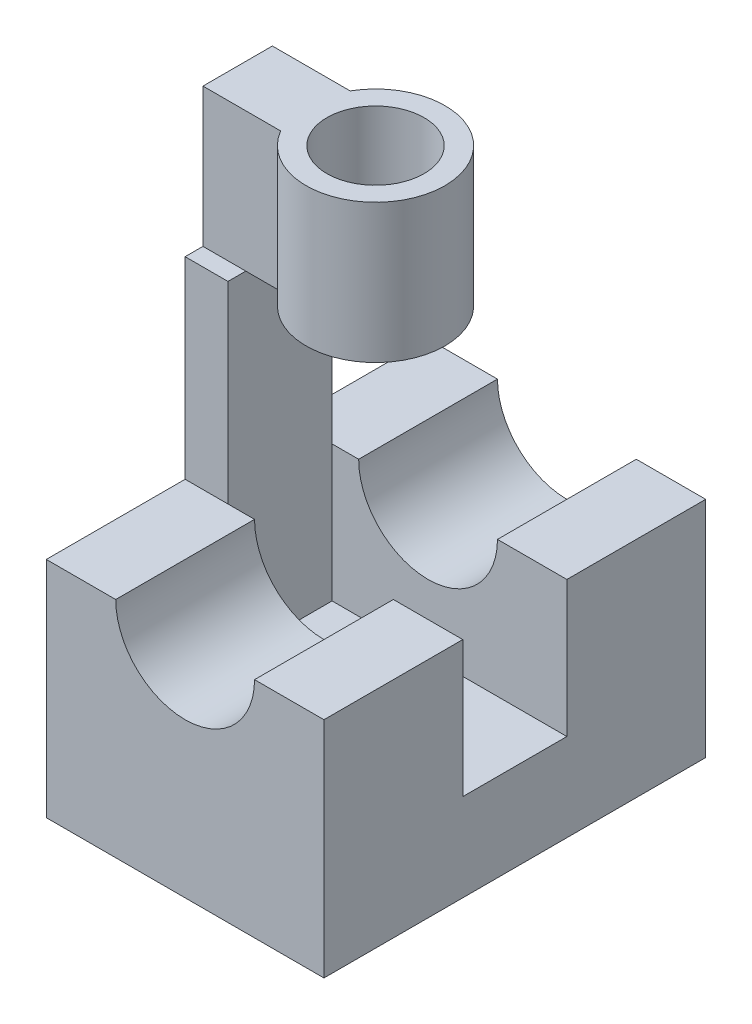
ISO-10303-21;
HEADER;
FILE_DESCRIPTION(('STEP AP214'),'2;1');
FILE_NAME('part.step','',(''),(''),'','','');
FILE_SCHEMA(('AUTOMOTIVE_DESIGN { 1 0 10303 214 1 1 1 1 }'));
ENDSEC;
DATA;
#1=APPLICATION_CONTEXT('core data for automotive mechanical design processes');
#2=APPLICATION_PROTOCOL_DEFINITION('international standard','automotive_design',2000,#1);
#3=PRODUCT_CONTEXT('',#1,'mechanical');
#4=PRODUCT('Part','Part','',(#3));
#5=PRODUCT_RELATED_PRODUCT_CATEGORY('part','',(#4));
#6=PRODUCT_DEFINITION_FORMATION('','',#4);
#7=PRODUCT_DEFINITION_CONTEXT('part definition',#1,'design');
#8=PRODUCT_DEFINITION('design','',#6,#7);
#9=PRODUCT_DEFINITION_SHAPE('','',#8);
#10=(LENGTH_UNIT() NAMED_UNIT(*) SI_UNIT(.MILLI.,.METRE.));
#11=(NAMED_UNIT(*) PLANE_ANGLE_UNIT() SI_UNIT($,.RADIAN.));
#12=(NAMED_UNIT(*) SI_UNIT($,.STERADIAN.) SOLID_ANGLE_UNIT());
#13=UNCERTAINTY_MEASURE_WITH_UNIT(LENGTH_MEASURE(1.E-05),#10,'distance_accuracy_value','');
#14=(GEOMETRIC_REPRESENTATION_CONTEXT(3) GLOBAL_UNCERTAINTY_ASSIGNED_CONTEXT((#13)) GLOBAL_UNIT_ASSIGNED_CONTEXT((#10,
#11,#12)) REPRESENTATION_CONTEXT('',''));
#15=CARTESIAN_POINT('',(0.,0.,0.));
#16=DIRECTION('',(0.,0.,1.));
#17=DIRECTION('',(1.,0.,0.));
#18=AXIS2_PLACEMENT_3D('',#15,#16,#17);
#19=CARTESIAN_POINT('',(0.,60.,0.));
#20=DIRECTION('',(0.,1.,0.));
#21=DIRECTION('',(0.,0.,1.));
#22=AXIS2_PLACEMENT_3D('',#19,#20,#21);
#23=PLANE('',#22);
#24=DIRECTION('',(1.,0.,0.));
#25=VECTOR('',#24,1.);
#26=CARTESIAN_POINT('',(11.2000754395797,60.,32.4301647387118));
#27=LINE('',#26,#25);
#28=CARTESIAN_POINT('',(0.,60.,32.4301647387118));
#29=VERTEX_POINT('',#28);
#30=CARTESIAN_POINT('',(6.17261826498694,60.,32.4301647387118));
#31=VERTEX_POINT('',#30);
#32=EDGE_CURVE('E207',#29,#31,#27,.T.);
#33=ORIENTED_EDGE('',*,*,#32,.F.);
#34=DIRECTION('',(0.,0.,1.));
#35=VECTOR('',#34,1.);
#36=CARTESIAN_POINT('',(0.,60.,20.));
#37=LINE('',#36,#35);
#38=CARTESIAN_POINT('',(0.,60.,35.));
#39=VERTEX_POINT('',#38);
#40=EDGE_CURVE('E199',#29,#39,#37,.T.);
#41=ORIENTED_EDGE('',*,*,#40,.T.);
#42=DIRECTION('',(1.,0.,0.));
#43=VECTOR('',#42,1.);
#44=CARTESIAN_POINT('',(0.,60.,35.));
#45=LINE('',#44,#43);
#46=CARTESIAN_POINT('',(6.17261826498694,60.,35.));
#47=VERTEX_POINT('',#46);
#48=EDGE_CURVE('E238',#39,#47,#45,.T.);
#49=ORIENTED_EDGE('',*,*,#48,.T.);
#50=DIRECTION('',(0.,0.,-1.));
#51=VECTOR('',#50,1.);
#52=CARTESIAN_POINT('',(6.17261826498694,60.,20.));
#53=LINE('',#52,#51);
#54=EDGE_CURVE('E234',#47,#31,#53,.T.);
#55=ORIENTED_EDGE('',*,*,#54,.T.);
#56=EDGE_LOOP('',(#33,#41,#49,#55));
#57=FACE_BOUND('',#56,.T.);
#58=ADVANCED_FACE('F34',(#57),#23,.T.);
#59=CARTESIAN_POINT('',(30.,32.2264797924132,55.));
#60=DIRECTION('',(0.,-1.,0.));
#61=DIRECTION('',(0.,0.,-1.));
#62=AXIS2_PLACEMENT_3D('',#59,#60,#61);
#63=PLANE('',#62);
#64=DIRECTION('',(0.,0.,-1.));
#65=VECTOR('',#64,1.);
#66=CARTESIAN_POINT('',(40.,32.2264797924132,55.));
#67=LINE('',#66,#65);
#68=CARTESIAN_POINT('',(40.,32.2264797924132,55.));
#69=VERTEX_POINT('',#68);
#70=CARTESIAN_POINT('',(40.,32.2264797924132,35.));
#71=VERTEX_POINT('',#70);
#72=EDGE_CURVE('E326',#69,#71,#67,.T.);
#73=ORIENTED_EDGE('',*,*,#72,.T.);
#74=DIRECTION('',(1.,0.,0.));
#75=VECTOR('',#74,1.);
#76=CARTESIAN_POINT('',(-15.,32.2264797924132,35.));
#77=LINE('',#76,#75);
#78=CARTESIAN_POINT('',(30.,32.2264797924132,35.));
#79=VERTEX_POINT('',#78);
#80=EDGE_CURVE('E263',#79,#71,#77,.T.);
#81=ORIENTED_EDGE('',*,*,#80,.F.);
#82=DIRECTION('',(0.,0.,-1.));
#83=VECTOR('',#82,1.);
#84=CARTESIAN_POINT('',(30.,32.2264797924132,55.));
#85=LINE('',#84,#83);
#86=CARTESIAN_POINT('',(30.,32.2264797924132,55.));
#87=VERTEX_POINT('',#86);
#88=EDGE_CURVE('E322',#87,#79,#85,.T.);
#89=ORIENTED_EDGE('',*,*,#88,.F.);
#90=DIRECTION('',(-1.,0.,0.));
#91=VECTOR('',#90,1.);
#92=CARTESIAN_POINT('',(30.,32.2264797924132,55.));
#93=LINE('',#92,#91);
#94=EDGE_CURVE('E288',#69,#87,#93,.T.);
#95=ORIENTED_EDGE('',*,*,#94,.F.);
#96=EDGE_LOOP('',(#73,#81,#89,#95));
#97=FACE_BOUND('',#96,.T.);
#98=ADVANCED_FACE('F356',(#97),#63,.F.);
#99=CARTESIAN_POINT('',(20.,32.2264797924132,55.));
#100=DIRECTION('',(0.,0.,-1.));
#101=DIRECTION('',(-1.,0.,0.));
#102=AXIS2_PLACEMENT_3D('',#99,#100,#101);
#103=CYLINDRICAL_SURFACE('',#102,10.);
#104=ORIENTED_EDGE('',*,*,#88,.T.);
#105=CARTESIAN_POINT('',(20.,32.2264797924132,35.));
#106=DIRECTION('',(0.,0.,1.));
#107=DIRECTION('',(1.,0.,0.));
#108=AXIS2_PLACEMENT_3D('',#105,#106,#107);
#109=CIRCLE('',#108,10.);
#110=CARTESIAN_POINT('',(10.,32.2264797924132,35.));
#111=VERTEX_POINT('',#110);
#112=EDGE_CURVE('E278',#79,#111,#109,.F.);
#113=ORIENTED_EDGE('',*,*,#112,.T.);
#114=DIRECTION('',(0.,0.,-1.));
#115=VECTOR('',#114,1.);
#116=CARTESIAN_POINT('',(10.,32.2264797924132,55.));
#117=LINE('',#116,#115);
#118=CARTESIAN_POINT('',(10.,32.2264797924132,55.));
#119=VERTEX_POINT('',#118);
#120=EDGE_CURVE('E318',#119,#111,#117,.T.);
#121=ORIENTED_EDGE('',*,*,#120,.F.);
#122=CARTESIAN_POINT('',(20.,32.2264797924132,55.));
#123=DIRECTION('',(0.,0.,-1.));
#124=DIRECTION('',(1.,0.,0.));
#125=AXIS2_PLACEMENT_3D('',#122,#123,#124);
#126=CIRCLE('',#125,10.);
#127=EDGE_CURVE('E290',#87,#119,#126,.T.);
#128=ORIENTED_EDGE('',*,*,#127,.F.);
#129=EDGE_LOOP('',(#104,#113,#121,#128));
#130=FACE_BOUND('',#129,.T.);
#131=ADVANCED_FACE('F363',(#130),#103,.F.);
#132=CARTESIAN_POINT('',(0.,32.2264797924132,55.));
#133=DIRECTION('',(0.,-1.,0.));
#134=DIRECTION('',(0.,0.,-1.));
#135=AXIS2_PLACEMENT_3D('',#132,#133,#134);
#136=PLANE('',#135);
#137=ORIENTED_EDGE('',*,*,#120,.T.);
#138=CARTESIAN_POINT('',(6.17261826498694,32.2264797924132,35.));
#139=VERTEX_POINT('',#138);
#140=EDGE_CURVE('E265',#139,#111,#77,.T.);
#141=ORIENTED_EDGE('',*,*,#140,.F.);
#142=CARTESIAN_POINT('',(0.,32.2264797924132,35.));
#143=VERTEX_POINT('',#142);
#144=EDGE_CURVE('E267',#143,#139,#77,.T.);
#145=ORIENTED_EDGE('',*,*,#144,.F.);
#146=DIRECTION('',(0.,0.,-1.));
#147=VECTOR('',#146,1.);
#148=CARTESIAN_POINT('',(0.,32.2264797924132,55.));
#149=LINE('',#148,#147);
#150=CARTESIAN_POINT('',(0.,32.2264797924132,55.));
#151=VERTEX_POINT('',#150);
#152=EDGE_CURVE('E315',#151,#143,#149,.T.);
#153=ORIENTED_EDGE('',*,*,#152,.F.);
#154=DIRECTION('',(-1.,0.,0.));
#155=VECTOR('',#154,1.);
#156=CARTESIAN_POINT('',(0.,32.2264797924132,55.));
#157=LINE('',#156,#155);
#158=EDGE_CURVE('E292',#119,#151,#157,.T.);
#159=ORIENTED_EDGE('',*,*,#158,.F.);
#160=EDGE_LOOP('',(#137,#141,#145,#153,#159));
#161=FACE_BOUND('',#160,.T.);
#162=ADVANCED_FACE('F411',(#161),#136,.F.);
#163=CARTESIAN_POINT('',(40.,0.,55.));
#164=DIRECTION('',(0.,1.,0.));
#165=DIRECTION('',(-1.,0.,0.));
#166=AXIS2_PLACEMENT_3D('',#163,#164,#165);
#167=PLANE('',#166);
#168=DIRECTION('',(1.,0.,0.));
#169=VECTOR('',#168,1.);
#170=CARTESIAN_POINT('',(40.,0.,0.));
#171=LINE('',#170,#169);
#172=CARTESIAN_POINT('',(0.,0.,0.));
#173=VERTEX_POINT('',#172);
#174=CARTESIAN_POINT('',(40.,0.,0.));
#175=VERTEX_POINT('',#174);
#176=EDGE_CURVE('E281',#173,#175,#171,.T.);
#177=ORIENTED_EDGE('',*,*,#176,.T.);
#178=DIRECTION('',(0.,0.,-1.));
#179=VECTOR('',#178,1.);
#180=CARTESIAN_POINT('',(40.,0.,55.));
#181=LINE('',#180,#179);
#182=CARTESIAN_POINT('',(40.,0.,55.));
#183=VERTEX_POINT('',#182);
#184=EDGE_CURVE('E329',#183,#175,#181,.T.);
#185=ORIENTED_EDGE('',*,*,#184,.F.);
#186=DIRECTION('',(1.,0.,0.));
#187=VECTOR('',#186,1.);
#188=CARTESIAN_POINT('',(40.,0.,55.));
#189=LINE('',#188,#187);
#190=CARTESIAN_POINT('',(0.,0.,55.));
#191=VERTEX_POINT('',#190);
#192=EDGE_CURVE('E282',#191,#183,#189,.T.);
#193=ORIENTED_EDGE('',*,*,#192,.F.);
#194=DIRECTION('',(0.,0.,-1.));
#195=VECTOR('',#194,1.);
#196=CARTESIAN_POINT('',(0.,0.,55.));
#197=LINE('',#196,#195);
#198=EDGE_CURVE('E296',#191,#173,#197,.T.);
#199=ORIENTED_EDGE('',*,*,#198,.T.);
#200=EDGE_LOOP('',(#177,#185,#193,#199));
#201=FACE_BOUND('',#200,.T.);
#202=ADVANCED_FACE('F36',(#201),#167,.F.);
#203=CARTESIAN_POINT('',(40.,32.2264797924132,55.));
#204=DIRECTION('',(-1.,0.,0.));
#205=DIRECTION('',(0.,-1.,0.));
#206=AXIS2_PLACEMENT_3D('',#203,#204,#205);
#207=PLANE('',#206);
#208=DIRECTION('',(0.,0.,-1.));
#209=VECTOR('',#208,1.);
#210=CARTESIAN_POINT('',(40.,12.6301340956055,35.));
#211=LINE('',#210,#209);
#212=CARTESIAN_POINT('',(40.,12.6301340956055,35.));
#213=VERTEX_POINT('',#212);
#214=CARTESIAN_POINT('',(40.,12.6301340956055,20.));
#215=VERTEX_POINT('',#214);
#216=EDGE_CURVE('E257',#213,#215,#211,.T.);
#217=ORIENTED_EDGE('',*,*,#216,.F.);
#218=DIRECTION('',(0.,-1.,0.));
#219=VECTOR('',#218,1.);
#220=CARTESIAN_POINT('',(40.,32.2264797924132,35.));
#221=LINE('',#220,#219);
#222=EDGE_CURVE('E246',#71,#213,#221,.T.);
#223=ORIENTED_EDGE('',*,*,#222,.F.);
#224=ORIENTED_EDGE('',*,*,#72,.F.);
#225=DIRECTION('',(0.,1.,0.));
#226=VECTOR('',#225,1.);
#227=CARTESIAN_POINT('',(40.,32.2264797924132,55.));
#228=LINE('',#227,#226);
#229=EDGE_CURVE('E285',#183,#69,#228,.T.);
#230=ORIENTED_EDGE('',*,*,#229,.F.);
#231=ORIENTED_EDGE('',*,*,#184,.T.);
#232=DIRECTION('',(0.,1.,0.));
#233=VECTOR('',#232,1.);
#234=CARTESIAN_POINT('',(40.,32.2264797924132,0.));
#235=LINE('',#234,#233);
#236=CARTESIAN_POINT('',(40.,32.2264797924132,0.));
#237=VERTEX_POINT('',#236);
#238=EDGE_CURVE('E299',#175,#237,#235,.T.);
#239=ORIENTED_EDGE('',*,*,#238,.T.);
#240=CARTESIAN_POINT('',(40.,32.2264797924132,20.));
#241=VERTEX_POINT('',#240);
#242=EDGE_CURVE('E325',#241,#237,#67,.T.);
#243=ORIENTED_EDGE('',*,*,#242,.F.);
#244=DIRECTION('',(0.,1.,0.));
#245=VECTOR('',#244,1.);
#246=CARTESIAN_POINT('',(40.,32.2264797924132,20.));
#247=LINE('',#246,#245);
#248=EDGE_CURVE('E260',#215,#241,#247,.T.);
#249=ORIENTED_EDGE('',*,*,#248,.F.);
#250=EDGE_LOOP('',(#217,#223,#224,#230,#231,#239,#243,#249));
#251=FACE_BOUND('',#250,.T.);
#252=ADVANCED_FACE('F415',(#251),#207,.F.);
#253=CARTESIAN_POINT('',(30.,32.2264797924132,20.));
#254=VERTEX_POINT('',#253);
#255=CARTESIAN_POINT('',(30.,32.2264797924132,0.));
#256=VERTEX_POINT('',#255);
#257=EDGE_CURVE('E321',#254,#256,#85,.T.);
#258=ORIENTED_EDGE('',*,*,#257,.F.);
#259=DIRECTION('',(1.,0.,0.));
#260=VECTOR('',#259,1.);
#261=CARTESIAN_POINT('',(-15.,32.2264797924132,20.));
#262=LINE('',#261,#260);
#263=EDGE_CURVE('E268',#254,#241,#262,.T.);
#264=ORIENTED_EDGE('',*,*,#263,.T.);
#265=ORIENTED_EDGE('',*,*,#242,.T.);
#266=DIRECTION('',(-1.,0.,0.));
#267=VECTOR('',#266,1.);
#268=CARTESIAN_POINT('',(30.,32.2264797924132,0.));
#269=LINE('',#268,#267);
#270=EDGE_CURVE('E302',#237,#256,#269,.T.);
#271=ORIENTED_EDGE('',*,*,#270,.T.);
#272=EDGE_LOOP('',(#258,#264,#265,#271));
#273=FACE_BOUND('',#272,.T.);
#274=ADVANCED_FACE('F366',(#273),#63,.F.);
#275=CARTESIAN_POINT('',(10.,32.2264797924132,20.));
#276=VERTEX_POINT('',#275);
#277=CARTESIAN_POINT('',(10.,32.2264797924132,0.));
#278=VERTEX_POINT('',#277);
#279=EDGE_CURVE('E317',#276,#278,#117,.T.);
#280=ORIENTED_EDGE('',*,*,#279,.F.);
#281=CARTESIAN_POINT('',(20.,32.2264797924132,20.));
#282=DIRECTION('',(0.,0.,-1.));
#283=DIRECTION('',(-1.,0.,0.));
#284=AXIS2_PLACEMENT_3D('',#281,#282,#283);
#285=CIRCLE('',#284,10.);
#286=EDGE_CURVE('E275',#276,#254,#285,.F.);
#287=ORIENTED_EDGE('',*,*,#286,.T.);
#288=ORIENTED_EDGE('',*,*,#257,.T.);
#289=CARTESIAN_POINT('',(20.,32.2264797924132,0.));
#290=DIRECTION('',(0.,0.,-1.));
#291=DIRECTION('',(1.,0.,0.));
#292=AXIS2_PLACEMENT_3D('',#289,#290,#291);
#293=CIRCLE('',#292,10.);
#294=EDGE_CURVE('E305',#256,#278,#293,.T.);
#295=ORIENTED_EDGE('',*,*,#294,.T.);
#296=EDGE_LOOP('',(#280,#287,#288,#295));
#297=FACE_BOUND('',#296,.T.);
#298=ADVANCED_FACE('F409',(#297),#103,.F.);
#299=CARTESIAN_POINT('',(0.,32.2264797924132,20.));
#300=VERTEX_POINT('',#299);
#301=CARTESIAN_POINT('',(0.,32.2264797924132,0.));
#302=VERTEX_POINT('',#301);
#303=EDGE_CURVE('E314',#300,#302,#149,.T.);
#304=ORIENTED_EDGE('',*,*,#303,.F.);
#305=CARTESIAN_POINT('',(6.17261826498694,32.2264797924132,20.));
#306=VERTEX_POINT('',#305);
#307=EDGE_CURVE('E266',#300,#306,#262,.T.);
#308=ORIENTED_EDGE('',*,*,#307,.T.);
#309=EDGE_CURVE('E271',#306,#276,#262,.T.);
#310=ORIENTED_EDGE('',*,*,#309,.T.);
#311=ORIENTED_EDGE('',*,*,#279,.T.);
#312=DIRECTION('',(-1.,0.,0.));
#313=VECTOR('',#312,1.);
#314=CARTESIAN_POINT('',(0.,32.2264797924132,0.));
#315=LINE('',#314,#313);
#316=EDGE_CURVE('E308',#278,#302,#315,.T.);
#317=ORIENTED_EDGE('',*,*,#316,.T.);
#318=EDGE_LOOP('',(#304,#308,#310,#311,#317));
#319=FACE_BOUND('',#318,.T.);
#320=ADVANCED_FACE('F406',(#319),#136,.F.);
#321=CARTESIAN_POINT('',(0.,0.,55.));
#322=DIRECTION('',(1.,0.,0.));
#323=DIRECTION('',(0.,0.,-1.));
#324=AXIS2_PLACEMENT_3D('',#321,#322,#323);
#325=PLANE('',#324);
#326=ORIENTED_EDGE('',*,*,#152,.T.);
#327=DIRECTION('',(0.,1.,0.));
#328=VECTOR('',#327,1.);
#329=CARTESIAN_POINT('',(0.,9.99999999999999,35.));
#330=LINE('',#329,#328);
#331=EDGE_CURVE('E243',#143,#39,#330,.T.);
#332=ORIENTED_EDGE('',*,*,#331,.T.);
#333=ORIENTED_EDGE('',*,*,#40,.F.);
#334=DIRECTION('',(0.,-1.,0.));
#335=VECTOR('',#334,1.);
#336=CARTESIAN_POINT('',(0.,80.,32.4301647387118));
#337=LINE('',#336,#335);
#338=CARTESIAN_POINT('',(0.,80.,32.4301647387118));
#339=VERTEX_POINT('',#338);
#340=EDGE_CURVE('E178',#339,#29,#337,.T.);
#341=ORIENTED_EDGE('',*,*,#340,.F.);
#342=DIRECTION('',(0.,0.,1.));
#343=VECTOR('',#342,1.);
#344=CARTESIAN_POINT('',(0.,80.,32.4301647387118));
#345=LINE('',#344,#343);
#346=CARTESIAN_POINT('',(0.,80.,22.4301647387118));
#347=VERTEX_POINT('',#346);
#348=EDGE_CURVE('E184',#347,#339,#345,.T.);
#349=ORIENTED_EDGE('',*,*,#348,.F.);
#350=DIRECTION('',(0.,-1.,0.));
#351=VECTOR('',#350,1.);
#352=CARTESIAN_POINT('',(0.,80.,22.4301647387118));
#353=LINE('',#352,#351);
#354=CARTESIAN_POINT('',(0.,60.,22.4301647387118));
#355=VERTEX_POINT('',#354);
#356=EDGE_CURVE('E222',#347,#355,#353,.T.);
#357=ORIENTED_EDGE('',*,*,#356,.T.);
#358=CARTESIAN_POINT('',(0.,60.,20.));
#359=VERTEX_POINT('',#358);
#360=EDGE_CURVE('E333',#359,#355,#37,.T.);
#361=ORIENTED_EDGE('',*,*,#360,.F.);
#362=DIRECTION('',(0.,1.,0.));
#363=VECTOR('',#362,1.);
#364=CARTESIAN_POINT('',(0.,9.99999999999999,20.));
#365=LINE('',#364,#363);
#366=EDGE_CURVE('E244',#300,#359,#365,.T.);
#367=ORIENTED_EDGE('',*,*,#366,.F.);
#368=ORIENTED_EDGE('',*,*,#303,.T.);
#369=DIRECTION('',(0.,-1.,0.));
#370=VECTOR('',#369,1.);
#371=CARTESIAN_POINT('',(0.,0.,0.));
#372=LINE('',#371,#370);
#373=EDGE_CURVE('E286',#302,#173,#372,.T.);
#374=ORIENTED_EDGE('',*,*,#373,.T.);
#375=ORIENTED_EDGE('',*,*,#198,.F.);
#376=DIRECTION('',(0.,-1.,0.));
#377=VECTOR('',#376,1.);
#378=CARTESIAN_POINT('',(0.,0.,55.));
#379=LINE('',#378,#377);
#380=EDGE_CURVE('E294',#151,#191,#379,.T.);
#381=ORIENTED_EDGE('',*,*,#380,.F.);
#382=EDGE_LOOP('',(#326,#332,#333,#341,#349,#357,#361,#367,#368,#374,#375,#381));
#383=FACE_BOUND('',#382,.T.);
#384=ADVANCED_FACE('F197',(#383),#325,.F.);
#385=CARTESIAN_POINT('',(20.,32.2264797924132,55.));
#386=DIRECTION('',(0.,0.,1.));
#387=DIRECTION('',(1.,0.,0.));
#388=AXIS2_PLACEMENT_3D('',#385,#386,#387);
#389=PLANE('',#388);
#390=ORIENTED_EDGE('',*,*,#192,.T.);
#391=ORIENTED_EDGE('',*,*,#229,.T.);
#392=ORIENTED_EDGE('',*,*,#94,.T.);
#393=ORIENTED_EDGE('',*,*,#127,.T.);
#394=ORIENTED_EDGE('',*,*,#158,.T.);
#395=ORIENTED_EDGE('',*,*,#380,.T.);
#396=EDGE_LOOP('',(#390,#391,#392,#393,#394,#395));
#397=FACE_BOUND('',#396,.T.);
#398=ADVANCED_FACE('F397',(#397),#389,.T.);
#399=CARTESIAN_POINT('',(20.,32.2264797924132,0.));
#400=DIRECTION('',(0.,0.,1.));
#401=DIRECTION('',(1.,0.,0.));
#402=AXIS2_PLACEMENT_3D('',#399,#400,#401);
#403=PLANE('',#402);
#404=ORIENTED_EDGE('',*,*,#176,.F.);
#405=ORIENTED_EDGE('',*,*,#373,.F.);
#406=ORIENTED_EDGE('',*,*,#316,.F.);
#407=ORIENTED_EDGE('',*,*,#294,.F.);
#408=ORIENTED_EDGE('',*,*,#270,.F.);
#409=ORIENTED_EDGE('',*,*,#238,.F.);
#410=EDGE_LOOP('',(#404,#405,#406,#407,#408,#409));
#411=FACE_BOUND('',#410,.T.);
#412=ADVANCED_FACE('F395',(#411),#403,.F.);
#413=CARTESIAN_POINT('',(-15.,32.2264797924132,35.));
#414=DIRECTION('',(0.,0.,1.));
#415=DIRECTION('',(1.,0.,0.));
#416=AXIS2_PLACEMENT_3D('',#413,#414,#415);
#417=PLANE('',#416);
#418=DIRECTION('',(1.,0.,0.));
#419=VECTOR('',#418,1.);
#420=CARTESIAN_POINT('',(-15.,12.6301340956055,35.));
#421=LINE('',#420,#419);
#422=CARTESIAN_POINT('',(6.17261826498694,12.6301340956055,35.));
#423=VERTEX_POINT('',#422);
#424=EDGE_CURVE('E262',#423,#213,#421,.T.);
#425=ORIENTED_EDGE('',*,*,#424,.F.);
#426=DIRECTION('',(0.,1.,0.));
#427=VECTOR('',#426,1.);
#428=CARTESIAN_POINT('',(6.17261826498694,9.99999999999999,35.));
#429=LINE('',#428,#427);
#430=EDGE_CURVE('E251',#423,#139,#429,.T.);
#431=ORIENTED_EDGE('',*,*,#430,.T.);
#432=ORIENTED_EDGE('',*,*,#140,.T.);
#433=ORIENTED_EDGE('',*,*,#112,.F.);
#434=ORIENTED_EDGE('',*,*,#80,.T.);
#435=ORIENTED_EDGE('',*,*,#222,.T.);
#436=EDGE_LOOP('',(#425,#431,#432,#433,#434,#435));
#437=FACE_BOUND('',#436,.T.);
#438=ADVANCED_FACE('F388',(#437),#417,.F.);
#439=CARTESIAN_POINT('',(-15.,32.2264797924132,20.));
#440=DIRECTION('',(0.,0.,-1.));
#441=DIRECTION('',(-1.,0.,0.));
#442=AXIS2_PLACEMENT_3D('',#439,#440,#441);
#443=PLANE('',#442);
#444=ORIENTED_EDGE('',*,*,#309,.F.);
#445=DIRECTION('',(0.,1.,0.));
#446=VECTOR('',#445,1.);
#447=CARTESIAN_POINT('',(6.17261826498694,9.99999999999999,20.));
#448=LINE('',#447,#446);
#449=CARTESIAN_POINT('',(6.17261826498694,12.6301340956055,20.));
#450=VERTEX_POINT('',#449);
#451=EDGE_CURVE('E247',#450,#306,#448,.T.);
#452=ORIENTED_EDGE('',*,*,#451,.F.);
#453=DIRECTION('',(1.,0.,0.));
#454=VECTOR('',#453,1.);
#455=CARTESIAN_POINT('',(-15.,12.6301340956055,20.));
#456=LINE('',#455,#454);
#457=EDGE_CURVE('E272',#450,#215,#456,.T.);
#458=ORIENTED_EDGE('',*,*,#457,.T.);
#459=ORIENTED_EDGE('',*,*,#248,.T.);
#460=ORIENTED_EDGE('',*,*,#263,.F.);
#461=ORIENTED_EDGE('',*,*,#286,.F.);
#462=EDGE_LOOP('',(#444,#452,#458,#459,#460,#461));
#463=FACE_BOUND('',#462,.T.);
#464=ADVANCED_FACE('F384',(#463),#443,.F.);
#465=CARTESIAN_POINT('',(-15.,12.6301340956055,35.));
#466=DIRECTION('',(0.,-1.,0.));
#467=DIRECTION('',(1.,0.,0.));
#468=AXIS2_PLACEMENT_3D('',#465,#466,#467);
#469=PLANE('',#468);
#470=ORIENTED_EDGE('',*,*,#457,.F.);
#471=DIRECTION('',(0.,0.,1.));
#472=VECTOR('',#471,1.);
#473=CARTESIAN_POINT('',(6.17261826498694,12.6301340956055,35.));
#474=LINE('',#473,#472);
#475=EDGE_CURVE('E43',#450,#423,#474,.T.);
#476=ORIENTED_EDGE('',*,*,#475,.T.);
#477=ORIENTED_EDGE('',*,*,#424,.T.);
#478=ORIENTED_EDGE('',*,*,#216,.T.);
#479=EDGE_LOOP('',(#470,#476,#477,#478));
#480=FACE_BOUND('',#479,.T.);
#481=ADVANCED_FACE('F387',(#480),#469,.F.);
#482=CARTESIAN_POINT('',(0.,9.99999999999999,20.));
#483=DIRECTION('',(0.,0.,-1.));
#484=DIRECTION('',(-1.,0.,0.));
#485=AXIS2_PLACEMENT_3D('',#482,#483,#484);
#486=PLANE('',#485);
#487=ORIENTED_EDGE('',*,*,#307,.F.);
#488=ORIENTED_EDGE('',*,*,#366,.T.);
#489=DIRECTION('',(-1.,0.,0.));
#490=VECTOR('',#489,1.);
#491=CARTESIAN_POINT('',(0.,60.,20.));
#492=LINE('',#491,#490);
#493=CARTESIAN_POINT('',(6.17261826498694,60.,20.));
#494=VERTEX_POINT('',#493);
#495=EDGE_CURVE('E237',#494,#359,#492,.T.);
#496=ORIENTED_EDGE('',*,*,#495,.F.);
#497=EDGE_CURVE('E248',#306,#494,#448,.T.);
#498=ORIENTED_EDGE('',*,*,#497,.F.);
#499=EDGE_LOOP('',(#487,#488,#496,#498));
#500=FACE_BOUND('',#499,.T.);
#501=ADVANCED_FACE('F381',(#500),#486,.T.);
#502=CARTESIAN_POINT('',(6.17261826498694,9.99999999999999,20.));
#503=DIRECTION('',(1.,0.,0.));
#504=DIRECTION('',(0.,0.,-1.));
#505=AXIS2_PLACEMENT_3D('',#502,#503,#504);
#506=PLANE('',#505);
#507=ORIENTED_EDGE('',*,*,#475,.F.);
#508=ORIENTED_EDGE('',*,*,#451,.T.);
#509=ORIENTED_EDGE('',*,*,#497,.T.);
#510=CARTESIAN_POINT('',(6.17261826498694,60.,22.4301647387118));
#511=VERTEX_POINT('',#510);
#512=EDGE_CURVE('E235',#511,#494,#53,.T.);
#513=ORIENTED_EDGE('',*,*,#512,.F.);
#514=EDGE_CURVE('E56',#31,#511,#53,.T.);
#515=ORIENTED_EDGE('',*,*,#514,.F.);
#516=ORIENTED_EDGE('',*,*,#54,.F.);
#517=EDGE_CURVE('E252',#139,#47,#429,.T.);
#518=ORIENTED_EDGE('',*,*,#517,.F.);
#519=ORIENTED_EDGE('',*,*,#430,.F.);
#520=EDGE_LOOP('',(#507,#508,#509,#513,#515,#516,#518,#519));
#521=FACE_BOUND('',#520,.T.);
#522=ADVANCED_FACE('F375',(#521),#506,.T.);
#523=CARTESIAN_POINT('',(0.,9.99999999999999,35.));
#524=DIRECTION('',(0.,0.,1.));
#525=DIRECTION('',(1.,0.,0.));
#526=AXIS2_PLACEMENT_3D('',#523,#524,#525);
#527=PLANE('',#526);
#528=ORIENTED_EDGE('',*,*,#144,.T.);
#529=ORIENTED_EDGE('',*,*,#517,.T.);
#530=ORIENTED_EDGE('',*,*,#48,.F.);
#531=ORIENTED_EDGE('',*,*,#331,.F.);
#532=EDGE_LOOP('',(#528,#529,#530,#531));
#533=FACE_BOUND('',#532,.T.);
#534=ADVANCED_FACE('F369',(#533),#527,.T.);
#535=DIRECTION('',(-1.,0.,0.));
#536=VECTOR('',#535,1.);
#537=CARTESIAN_POINT('',(0.,60.,22.4301647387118));
#538=LINE('',#537,#536);
#539=EDGE_CURVE('E11',#511,#355,#538,.T.);
#540=ORIENTED_EDGE('',*,*,#539,.F.);
#541=ORIENTED_EDGE('',*,*,#512,.T.);
#542=ORIENTED_EDGE('',*,*,#495,.T.);
#543=ORIENTED_EDGE('',*,*,#360,.T.);
#544=EDGE_LOOP('',(#540,#541,#542,#543));
#545=FACE_BOUND('',#544,.T.);
#546=ADVANCED_FACE('F359',(#545),#23,.T.);
#547=CARTESIAN_POINT('',(19.8603294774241,60.,27.4301647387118));
#548=DIRECTION('',(0.,1.,0.));
#549=DIRECTION('',(0.,0.,1.));
#550=AXIS2_PLACEMENT_3D('',#547,#548,#549);
#551=PLANE('',#550);
#552=CARTESIAN_POINT('',(19.8603294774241,60.,27.4301647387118));
#553=DIRECTION('',(0.,1.,0.));
#554=DIRECTION('',(0.,0.,1.));
#555=AXIS2_PLACEMENT_3D('',#552,#553,#554);
#556=CIRCLE('',#555,7.);
#557=CARTESIAN_POINT('',(19.8603294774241,60.,34.4301647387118));
#558=VERTEX_POINT('',#557);
#559=EDGE_CURVE('E200',#558,#558,#556,.T.);
#560=ORIENTED_EDGE('',*,*,#559,.T.);
#561=EDGE_LOOP('',(#560));
#562=FACE_BOUND('',#561,.T.);
#563=CARTESIAN_POINT('',(11.2000754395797,60.,32.4301647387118));
#564=VERTEX_POINT('',#563);
#565=EDGE_CURVE('E210',#31,#564,#27,.T.);
#566=ORIENTED_EDGE('',*,*,#565,.F.);
#567=ORIENTED_EDGE('',*,*,#514,.T.);
#568=CARTESIAN_POINT('',(11.2000754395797,60.,22.4301647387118));
#569=VERTEX_POINT('',#568);
#570=EDGE_CURVE('E193',#569,#511,#538,.T.);
#571=ORIENTED_EDGE('',*,*,#570,.F.);
#572=CARTESIAN_POINT('',(19.8603294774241,60.,27.4301647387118));
#573=DIRECTION('',(0.,1.,0.));
#574=DIRECTION('',(0.,0.,1.));
#575=AXIS2_PLACEMENT_3D('',#572,#573,#574);
#576=CIRCLE('',#575,10.);
#577=EDGE_CURVE('E233',#564,#569,#576,.T.);
#578=ORIENTED_EDGE('',*,*,#577,.F.);
#579=EDGE_LOOP('',(#566,#567,#571,#578));
#580=FACE_BOUND('',#579,.T.);
#581=ADVANCED_FACE('F232',(#562,#580),#551,.F.);
#582=CARTESIAN_POINT('',(19.8603294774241,80.,27.4301647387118));
#583=DIRECTION('',(0.,-1.,0.));
#584=DIRECTION('',(0.,0.,-1.));
#585=AXIS2_PLACEMENT_3D('',#582,#583,#584);
#586=CYLINDRICAL_SURFACE('',#585,10.);
#587=DIRECTION('',(0.,-1.,0.));
#588=VECTOR('',#587,1.);
#589=CARTESIAN_POINT('',(11.2000754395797,80.,32.4301647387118));
#590=LINE('',#589,#588);
#591=CARTESIAN_POINT('',(11.2000754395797,80.,32.4301647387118));
#592=VERTEX_POINT('',#591);
#593=EDGE_CURVE('E180',#592,#564,#590,.T.);
#594=ORIENTED_EDGE('',*,*,#593,.T.);
#595=ORIENTED_EDGE('',*,*,#577,.T.);
#596=DIRECTION('',(0.,-1.,0.));
#597=VECTOR('',#596,1.);
#598=CARTESIAN_POINT('',(11.2000754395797,80.,22.4301647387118));
#599=LINE('',#598,#597);
#600=CARTESIAN_POINT('',(11.2000754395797,80.,22.4301647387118));
#601=VERTEX_POINT('',#600);
#602=EDGE_CURVE('E204',#601,#569,#599,.T.);
#603=ORIENTED_EDGE('',*,*,#602,.F.);
#604=CARTESIAN_POINT('',(19.8603294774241,80.,27.4301647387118));
#605=DIRECTION('',(0.,1.,0.));
#606=DIRECTION('',(0.,0.,1.));
#607=AXIS2_PLACEMENT_3D('',#604,#605,#606);
#608=CIRCLE('',#607,10.);
#609=EDGE_CURVE('E338',#592,#601,#608,.T.);
#610=ORIENTED_EDGE('',*,*,#609,.F.);
#611=EDGE_LOOP('',(#594,#595,#603,#610));
#612=FACE_BOUND('',#611,.T.);
#613=ADVANCED_FACE('F346',(#612),#586,.T.);
#614=CARTESIAN_POINT('',(19.8603294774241,80.,27.4301647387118));
#615=DIRECTION('',(0.,1.,0.));
#616=DIRECTION('',(0.,0.,1.));
#617=AXIS2_PLACEMENT_3D('',#614,#615,#616);
#618=PLANE('',#617);
#619=DIRECTION('',(1.,0.,0.));
#620=VECTOR('',#619,1.);
#621=CARTESIAN_POINT('',(11.2000754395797,80.,32.4301647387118));
#622=LINE('',#621,#620);
#623=EDGE_CURVE('E173',#339,#592,#622,.T.);
#624=ORIENTED_EDGE('',*,*,#623,.T.);
#625=ORIENTED_EDGE('',*,*,#609,.T.);
#626=DIRECTION('',(-1.,0.,0.));
#627=VECTOR('',#626,1.);
#628=CARTESIAN_POINT('',(0.,80.,22.4301647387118));
#629=LINE('',#628,#627);
#630=EDGE_CURVE('E183',#601,#347,#629,.T.);
#631=ORIENTED_EDGE('',*,*,#630,.T.);
#632=ORIENTED_EDGE('',*,*,#348,.T.);
#633=EDGE_LOOP('',(#624,#625,#631,#632));
#634=FACE_BOUND('',#633,.T.);
#635=CARTESIAN_POINT('',(19.8603294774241,80.,27.4301647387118));
#636=DIRECTION('',(0.,1.,0.));
#637=DIRECTION('',(0.,0.,1.));
#638=AXIS2_PLACEMENT_3D('',#635,#636,#637);
#639=CIRCLE('',#638,7.);
#640=CARTESIAN_POINT('',(19.8603294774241,80.,34.4301647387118));
#641=VERTEX_POINT('',#640);
#642=EDGE_CURVE('E202',#641,#641,#639,.T.);
#643=ORIENTED_EDGE('',*,*,#642,.F.);
#644=EDGE_LOOP('',(#643));
#645=FACE_BOUND('',#644,.T.);
#646=ADVANCED_FACE('F187',(#634,#645),#618,.T.);
#647=CARTESIAN_POINT('',(19.8603294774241,80.,27.4301647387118));
#648=DIRECTION('',(0.,-1.,0.));
#649=DIRECTION('',(0.,0.,-1.));
#650=AXIS2_PLACEMENT_3D('',#647,#648,#649);
#651=CYLINDRICAL_SURFACE('',#650,7.);
#652=ORIENTED_EDGE('',*,*,#642,.T.);
#653=EDGE_LOOP('',(#652));
#654=FACE_BOUND('',#653,.T.);
#655=ORIENTED_EDGE('',*,*,#559,.F.);
#656=EDGE_LOOP('',(#655));
#657=FACE_BOUND('',#656,.T.);
#658=ADVANCED_FACE('F343',(#654,#657),#651,.F.);
#659=CARTESIAN_POINT('',(11.2000754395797,80.,32.4301647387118));
#660=DIRECTION('',(0.,0.,-1.));
#661=DIRECTION('',(-1.,0.,0.));
#662=AXIS2_PLACEMENT_3D('',#659,#660,#661);
#663=PLANE('',#662);
#664=ORIENTED_EDGE('',*,*,#32,.T.);
#665=ORIENTED_EDGE('',*,*,#565,.T.);
#666=ORIENTED_EDGE('',*,*,#593,.F.);
#667=ORIENTED_EDGE('',*,*,#623,.F.);
#668=ORIENTED_EDGE('',*,*,#340,.T.);
#669=EDGE_LOOP('',(#664,#665,#666,#667,#668));
#670=FACE_BOUND('',#669,.T.);
#671=ADVANCED_FACE('F176',(#670),#663,.F.);
#672=CARTESIAN_POINT('',(0.,80.,22.4301647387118));
#673=DIRECTION('',(0.,0.,1.));
#674=DIRECTION('',(1.,0.,0.));
#675=AXIS2_PLACEMENT_3D('',#672,#673,#674);
#676=PLANE('',#675);
#677=ORIENTED_EDGE('',*,*,#570,.T.);
#678=ORIENTED_EDGE('',*,*,#539,.T.);
#679=ORIENTED_EDGE('',*,*,#356,.F.);
#680=ORIENTED_EDGE('',*,*,#630,.F.);
#681=ORIENTED_EDGE('',*,*,#602,.T.);
#682=EDGE_LOOP('',(#677,#678,#679,#680,#681));
#683=FACE_BOUND('',#682,.T.);
#684=ADVANCED_FACE('F227',(#683),#676,.F.);
#685=CLOSED_SHELL('',(#58,#98,#131,#162,#202,#252,#274,#298,#320,#384,#398,#412,#438,#464,#481,
#501,#522,#534,#546,#581,#613,#646,#658,#671,#684));
#686=MANIFOLD_SOLID_BREP('B2',#685);
#687=ADVANCED_BREP_SHAPE_REPRESENTATION('',(#18,#686),#14);
#688=SHAPE_DEFINITION_REPRESENTATION(#9,#687);
ENDSEC;
END-ISO-10303-21;
